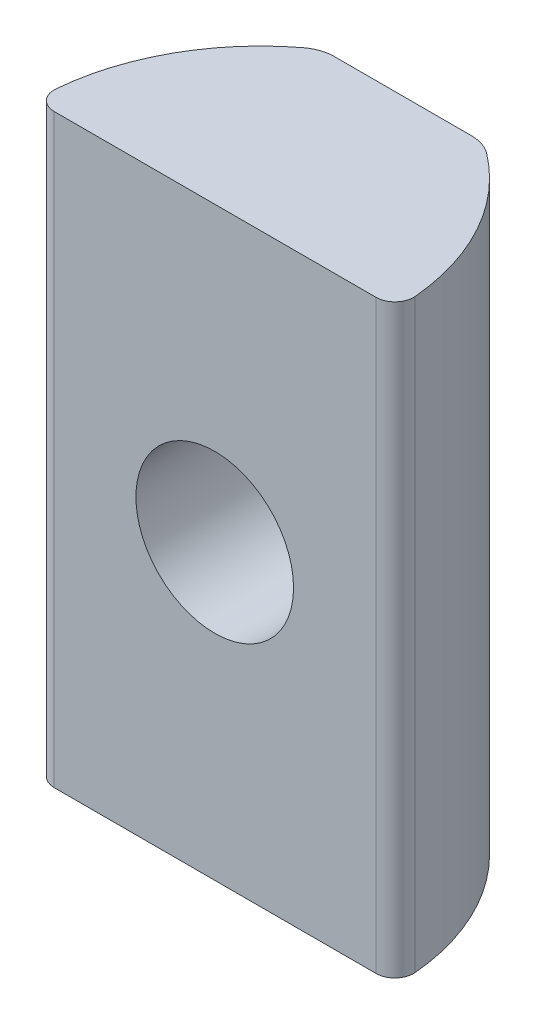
from build123d import *

# Parameters (mm, degrees)
EXTRUDE_1_DEPTH = 7.8
M5X0_8_1_D      = 4.2


with BuildPart() as part:
    # Sketch 1 → Extrude 1 (new, symmetric)
    with BuildSketch(Plane.XZ):
        with BuildLine():
            Line((-4.28842123, 0), (4.28842123, 0))
            ThreePointArc((4.28842123, 0), (4.657211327, -0.162370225), (4.786479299, -0.54402454))
            ThreePointArc((4.786479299, -0.54402454), (4.060490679, -2.919187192), (2.434814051, -4.796853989))
            ThreePointArc((2.434814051, -4.796853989), (2.149347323, -4.947853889), (1.830642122, -5))
            Line((1.830642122, -5), (-1.830642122, -5))
            ThreePointArc((-1.830642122, -5), (-2.149347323, -4.947853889), (-2.434814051, -4.796853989))
            ThreePointArc((-2.434814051, -4.796853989), (-4.060490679, -2.919187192), (-4.786479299, -0.54402454))
            ThreePointArc((-4.786479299, -0.54402454), (-4.657211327, -0.162370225), (-4.28842123, 0))
        make_face()
    extrude(amount=EXTRUDE_1_DEPTH, both=True)

    # M5x0.8 _1 (through all)
    with Locations(Plane(origin=(1.337388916, 5.214464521, 0), x_dir=(1, 0, 0), z_dir=(0, 0, 1))):
        with Locations((-1.348967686, -5.214464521)):
            Hole(M5X0_8_1_D / 2)


solid = part.part
